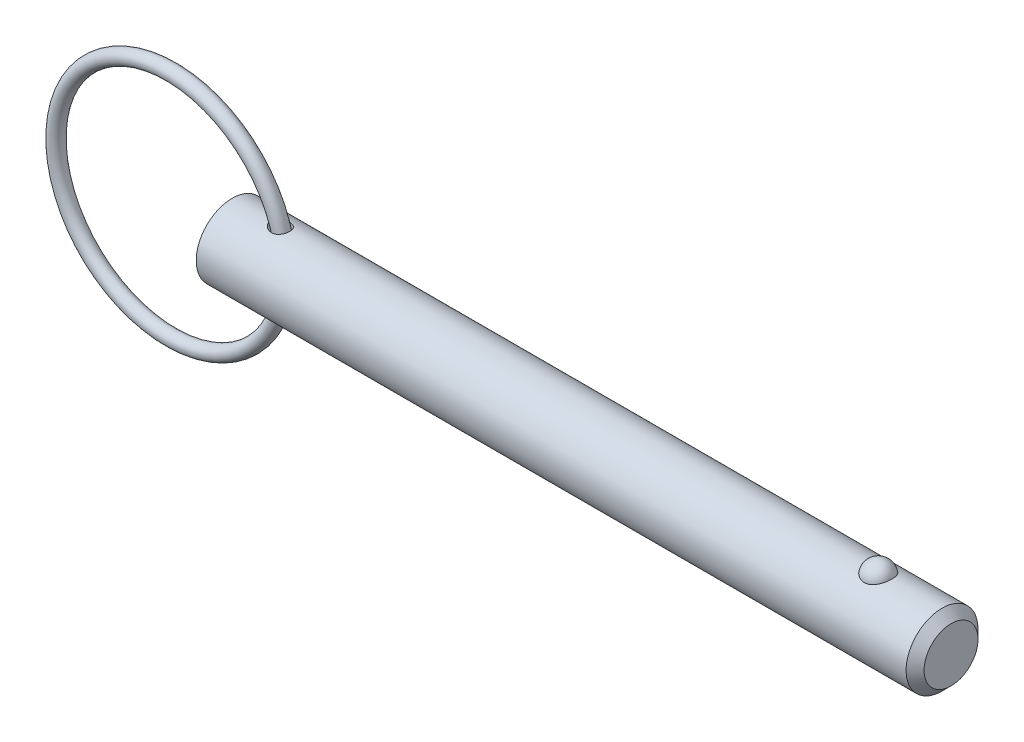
ISO-10303-21;
HEADER;
FILE_DESCRIPTION(('STEP AP214'),'2;1');
FILE_NAME('part.step','',(''),(''),'','','');
FILE_SCHEMA(('AUTOMOTIVE_DESIGN { 1 0 10303 214 1 1 1 1 }'));
ENDSEC;
DATA;
#1=APPLICATION_CONTEXT('core data for automotive mechanical design processes');
#2=APPLICATION_PROTOCOL_DEFINITION('international standard','automotive_design',2000,#1);
#3=PRODUCT_CONTEXT('',#1,'mechanical');
#4=PRODUCT('Part','Part','',(#3));
#5=PRODUCT_RELATED_PRODUCT_CATEGORY('part','',(#4));
#6=PRODUCT_DEFINITION_FORMATION('','',#4);
#7=PRODUCT_DEFINITION_CONTEXT('part definition',#1,'design');
#8=PRODUCT_DEFINITION('design','',#6,#7);
#9=PRODUCT_DEFINITION_SHAPE('','',#8);
#10=(LENGTH_UNIT() NAMED_UNIT(*) SI_UNIT(.MILLI.,.METRE.));
#11=(NAMED_UNIT(*) PLANE_ANGLE_UNIT() SI_UNIT($,.RADIAN.));
#12=(NAMED_UNIT(*) SI_UNIT($,.STERADIAN.) SOLID_ANGLE_UNIT());
#13=UNCERTAINTY_MEASURE_WITH_UNIT(LENGTH_MEASURE(1.E-05),#10,'distance_accuracy_value','');
#14=(GEOMETRIC_REPRESENTATION_CONTEXT(3) GLOBAL_UNCERTAINTY_ASSIGNED_CONTEXT((#13)) GLOBAL_UNIT_ASSIGNED_CONTEXT((#10,
#11,#12)) REPRESENTATION_CONTEXT('',''));
#15=CARTESIAN_POINT('',(0.,0.,0.));
#16=DIRECTION('',(0.,0.,1.));
#17=DIRECTION('',(1.,0.,0.));
#18=AXIS2_PLACEMENT_3D('',#15,#16,#17);
#19=CARTESIAN_POINT('',(-6.75433730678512,0.,0.));
#20=DIRECTION('',(0.,0.,1.));
#21=DIRECTION('',(1.,0.,0.));
#22=AXIS2_PLACEMENT_3D('',#19,#20,#21);
#23=TOROIDAL_SURFACE('',#22,12.7,0.794);
#24=CARTESIAN_POINT('',(6.73966269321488,0.,0.));
#25=VERTEX_POINT('',#24);
#26=VERTEX_LOOP('',#25);
#27=FACE_BOUND('',#26,.T.);
#28=ADVANCED_FACE('P0_F12',(#27),#23,.T.);
#29=CLOSED_SHELL('',(#28));
#30=MANIFOLD_SOLID_BREP('P0_B1',#29);
#31=CARTESIAN_POINT('',(0.,0.,0.));
#32=DIRECTION('',(1.,0.,0.));
#33=DIRECTION('',(0.,0.,-1.));
#34=AXIS2_PLACEMENT_3D('',#31,#32,#33);
#35=CYLINDRICAL_SURFACE('',#34,3.97);
#36=CARTESIAN_POINT('',(4.47423598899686,3.9272127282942,-0.581291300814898));
#37=CARTESIAN_POINT('',(4.51402362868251,3.92000695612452,-0.62997219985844));
#38=CARTESIAN_POINT('',(4.55825642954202,3.91241085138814,-0.675032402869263));
#39=CARTESIAN_POINT('',(4.65378532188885,3.8973704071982,-0.757069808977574));
#40=CARTESIAN_POINT('',(4.70509780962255,3.88992646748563,-0.794027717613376));
#41=CARTESIAN_POINT('',(4.81300878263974,3.87608600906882,-0.859045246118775));
#42=CARTESIAN_POINT('',(4.86959180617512,3.86968656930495,-0.887129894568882));
#43=CARTESIAN_POINT('',(4.98666757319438,3.85867771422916,-0.933854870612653));
#44=CARTESIAN_POINT('',(5.04715829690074,3.85406738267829,-0.952500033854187));
#45=CARTESIAN_POINT('',(5.17222686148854,3.84716625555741,-0.980011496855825));
#46=CARTESIAN_POINT('',(5.23687124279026,3.84494236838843,-0.988596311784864));
#47=CARTESIAN_POINT('',(5.36671178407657,3.84347581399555,-0.994286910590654));
#48=CARTESIAN_POINT('',(5.43190770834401,3.84423193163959,-0.991397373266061));
#49=CARTESIAN_POINT('',(5.5560514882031,3.84859691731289,-0.974304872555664));
#50=CARTESIAN_POINT('',(5.61511712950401,3.85200226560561,-0.960908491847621));
#51=CARTESIAN_POINT('',(5.72974412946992,3.8610605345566,-0.923836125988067));
#52=CARTESIAN_POINT('',(5.78530708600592,3.86671242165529,-0.90016486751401));
#53=CARTESIAN_POINT('',(5.88712740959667,3.87908259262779,-0.845190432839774));
#54=CARTESIAN_POINT('',(5.93376792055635,3.88569301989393,-0.814569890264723));
#55=CARTESIAN_POINT('',(6.02101503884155,3.89947732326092,-0.745789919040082));
#56=CARTESIAN_POINT('',(6.06162229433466,3.90665113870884,-0.707631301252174));
#57=CARTESIAN_POINT('',(6.13496290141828,3.9206013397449,-0.625680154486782));
#58=CARTESIAN_POINT('',(6.16783367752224,3.92738273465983,-0.582011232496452));
#59=CARTESIAN_POINT('',(6.2258925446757,3.93995609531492,-0.489706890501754));
#60=CARTESIAN_POINT('',(6.25108046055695,3.94574803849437,-0.441071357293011));
#61=CARTESIAN_POINT('',(6.29336449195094,3.95576358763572,-0.339770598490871));
#62=CARTESIAN_POINT('',(6.31039150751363,3.95997373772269,-0.28707520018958));
#63=CARTESIAN_POINT('',(6.33565624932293,3.96630600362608,-0.179496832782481));
#64=CARTESIAN_POINT('',(6.34389366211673,3.96842804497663,-0.124613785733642));
#65=CARTESIAN_POINT('',(6.35142037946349,3.97036465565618,-0.0138440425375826));
#66=CARTESIAN_POINT('',(6.35065227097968,3.97016441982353,0.0420468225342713));
#67=CARTESIAN_POINT('',(6.34004566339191,3.96744188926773,0.152904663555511));
#68=CARTESIAN_POINT('',(6.33020697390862,3.96491954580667,0.207871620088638));
#69=CARTESIAN_POINT('',(6.30166659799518,3.95782104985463,0.315369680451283));
#70=CARTESIAN_POINT('',(6.28295698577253,3.95324306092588,0.36789855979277));
#71=CARTESIAN_POINT('',(6.23710200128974,3.94253162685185,0.468965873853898));
#72=CARTESIAN_POINT('',(6.20995670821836,3.93639819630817,0.517504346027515));
#73=CARTESIAN_POINT('',(6.14798638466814,3.92327702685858,0.609041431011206));
#74=CARTESIAN_POINT('',(6.11318666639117,3.91629213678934,0.652057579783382));
#75=CARTESIAN_POINT('',(6.03675089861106,3.90223639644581,0.731492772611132));
#76=CARTESIAN_POINT('',(5.99511563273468,3.89516555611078,0.767912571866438));
#77=CARTESIAN_POINT('',(5.90657479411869,3.88180215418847,0.832828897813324));
#78=CARTESIAN_POINT('',(5.85972260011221,3.87550288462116,0.86139687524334));
#79=CARTESIAN_POINT('',(5.76177854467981,3.86429747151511,0.910350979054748));
#80=CARTESIAN_POINT('',(5.71068697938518,3.8593912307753,0.930737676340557));
#81=CARTESIAN_POINT('',(5.60571987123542,3.85147434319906,0.962976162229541));
#82=CARTESIAN_POINT('',(5.55184284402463,3.84846471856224,0.974823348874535));
#83=CARTESIAN_POINT('',(5.44283210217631,3.84460058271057,0.989953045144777));
#84=CARTESIAN_POINT('',(5.38769814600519,3.84374648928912,0.99323389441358));
#85=CARTESIAN_POINT('',(5.27524330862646,3.84420584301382,0.991454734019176));
#86=CARTESIAN_POINT('',(5.21792896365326,3.84561285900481,0.986034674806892));
#87=CARTESIAN_POINT('',(5.1048579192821,3.85052758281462,0.966661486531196));
#88=CARTESIAN_POINT('',(5.04910180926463,3.85403607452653,0.952705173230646));
#89=CARTESIAN_POINT('',(4.93593174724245,3.86308835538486,0.915340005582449));
#90=CARTESIAN_POINT('',(4.8787523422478,3.86877458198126,0.891254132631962));
#91=CARTESIAN_POINT('',(4.7690169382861,3.88143650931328,0.83438431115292));
#92=CARTESIAN_POINT('',(4.71646372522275,3.88841297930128,0.801595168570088));
#93=CARTESIAN_POINT('',(4.61492504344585,3.90324173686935,0.726056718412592));
#94=CARTESIAN_POINT('',(4.56625259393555,3.91112043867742,0.682888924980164));
#95=CARTESIAN_POINT('',(4.47749220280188,3.92644930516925,0.588370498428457));
#96=CARTESIAN_POINT('',(4.43740132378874,3.93389961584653,0.537022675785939));
#97=CARTESIAN_POINT('',(4.37035516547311,3.94686586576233,0.431042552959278));
#98=CARTESIAN_POINT('',(4.34268823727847,3.95247934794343,0.376876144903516));
#99=CARTESIAN_POINT('',(4.29855851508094,3.96161331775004,0.264011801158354));
#100=CARTESIAN_POINT('',(4.28207681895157,3.96513733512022,0.20532169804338));
#101=CARTESIAN_POINT('',(4.26319409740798,3.96919493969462,0.094762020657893));
#102=CARTESIAN_POINT('',(4.25904206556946,3.97009986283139,0.0432014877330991));
#103=CARTESIAN_POINT('',(4.26004223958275,3.9698827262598,-0.0598293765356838));
#104=CARTESIAN_POINT('',(4.26519288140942,3.96876100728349,-0.111299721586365));
#105=CARTESIAN_POINT('',(4.28369027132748,3.96479623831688,-0.208517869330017));
#106=CARTESIAN_POINT('',(4.29637416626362,3.96209263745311,-0.25440084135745));
#107=CARTESIAN_POINT('',(4.32867922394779,3.95536287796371,-0.343510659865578));
#108=CARTESIAN_POINT('',(4.34829584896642,3.95133758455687,-0.386739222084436));
#109=CARTESIAN_POINT('',(4.38573190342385,3.94389838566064,-0.455314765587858));
#110=CARTESIAN_POINT('',(4.40181371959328,3.94075686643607,-0.481662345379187));
#111=CARTESIAN_POINT('',(4.43632024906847,3.93417901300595,-0.532726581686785));
#112=CARTESIAN_POINT('',(4.45474473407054,3.93074270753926,-0.557443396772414));
#113=CARTESIAN_POINT('',(4.47423598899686,3.9272127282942,-0.581291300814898));
#114=B_SPLINE_CURVE_WITH_KNOTS('',3,(#36,#37,#38,#39,#40,#41,#42,#43,#44,#45,#46,#47,#48,#49,
#50,#51,#52,#53,#54,#55,#56,#57,#58,#59,#60,#61,#62,#63,#64,#65,#66,#67,#68,#69,#70,#71,#72,#73,
#74,#75,#76,#77,#78,#79,#80,#81,#82,#83,#84,#85,#86,#87,#88,#89,#90,#91,#92,#93,#94,#95,#96,#97,
#98,#99,#100,#101,#102,#103,#104,#105,#106,#107,#108,#109,#110,#111,#112,#113),.UNSPECIFIED.,
.T.,.F.,(4,2,2,2,2,2,2,2,2,2,2,2,2,2,2,2,2,2,2,2,2,2,2,2,2,2,2,2,2,2,2,2,2,2,2,2,2,2,4),(0.,
0.189730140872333,0.379907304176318,0.569543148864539,0.759081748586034,0.953805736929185,
1.148450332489,1.32946176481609,1.51039001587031,1.67812095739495,1.84583386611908,
2.01029437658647,2.17475863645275,2.34059186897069,2.50643101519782,2.67332801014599,
2.84022850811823,3.00727840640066,3.17432673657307,3.34083074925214,3.50731568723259,
3.67223129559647,3.83713539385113,4.00212829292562,4.16715316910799,4.33918465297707,
4.5112803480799,4.69738596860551,4.88360290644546,5.07919911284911,5.27472826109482,
5.45686425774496,5.63869168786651,5.79305070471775,5.94738377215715,6.08981233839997,
6.2321478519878,6.3251023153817,6.4180477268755),.UNSPECIFIED.);
#115=CARTESIAN_POINT('',(4.47423598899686,3.9272127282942,-0.581291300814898));
#116=VERTEX_POINT('',#115);
#117=EDGE_CURVE('P1_E40',#116,#116,#114,.T.);
#118=ORIENTED_EDGE('',*,*,#117,.T.);
#119=EDGE_LOOP('',(#118));
#120=FACE_BOUND('',#119,.T.);
#121=CARTESIAN_POINT('',(78.3875,0.,0.));
#122=DIRECTION('',(1.,0.,0.));
#123=DIRECTION('',(0.,0.,-1.));
#124=AXIS2_PLACEMENT_3D('',#121,#122,#123);
#125=CIRCLE('',#124,3.97);
#126=CARTESIAN_POINT('',(78.3875,0.,-3.97));
#127=VERTEX_POINT('',#126);
#128=EDGE_CURVE('P1_E25',#127,#127,#125,.T.);
#129=ORIENTED_EDGE('',*,*,#128,.F.);
#130=EDGE_LOOP('',(#129));
#131=FACE_BOUND('',#130,.T.);
#132=CARTESIAN_POINT('',(0.,0.,0.));
#133=DIRECTION('',(1.,0.,0.));
#134=DIRECTION('',(0.,0.,-1.));
#135=AXIS2_PLACEMENT_3D('',#132,#133,#134);
#136=CIRCLE('',#135,3.97);
#137=CARTESIAN_POINT('',(0.,0.,-3.97));
#138=VERTEX_POINT('',#137);
#139=EDGE_CURVE('P1_E9',#138,#138,#136,.T.);
#140=ORIENTED_EDGE('',*,*,#139,.T.);
#141=EDGE_LOOP('',(#140));
#142=FACE_BOUND('',#141,.T.);
#143=CARTESIAN_POINT('',(71.3451922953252,3.65715365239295,1.5447094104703));
#144=CARTESIAN_POINT('',(71.2652448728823,3.65716001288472,1.54470290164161));
#145=CARTESIAN_POINT('',(71.1851650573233,3.65987074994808,1.53832549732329));
#146=CARTESIAN_POINT('',(71.0272374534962,3.6704221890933,1.51297018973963));
#147=CARTESIAN_POINT('',(70.9493961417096,3.67827646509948,1.49395894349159));
#148=CARTESIAN_POINT('',(70.7984614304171,3.69818848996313,1.4439595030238));
#149=CARTESIAN_POINT('',(70.7253560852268,3.71023513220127,1.41300293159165));
#150=CARTESIAN_POINT('',(70.5855630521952,3.7372183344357,1.34000212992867));
#151=CARTESIAN_POINT('',(70.5188725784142,3.75215363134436,1.29796274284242));
#152=CARTESIAN_POINT('',(70.3914886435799,3.78384968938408,1.20248834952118));
#153=CARTESIAN_POINT('',(70.3310299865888,3.80065129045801,1.14875388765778));
#154=CARTESIAN_POINT('',(70.2196942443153,3.83398532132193,1.03205417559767));
#155=CARTESIAN_POINT('',(70.1688200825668,3.85051766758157,0.969086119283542));
#156=CARTESIAN_POINT('',(70.0756321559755,3.88238608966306,0.832526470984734));
#157=CARTESIAN_POINT('',(70.0337961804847,3.89763698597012,0.758588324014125));
#158=CARTESIAN_POINT('',(69.9625108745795,3.92451063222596,0.604352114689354));
#159=CARTESIAN_POINT('',(69.9330623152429,3.93613315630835,0.52405365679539));
#160=CARTESIAN_POINT('',(69.8868927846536,3.95467606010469,0.358403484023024));
#161=CARTESIAN_POINT('',(69.8703127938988,3.96154426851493,0.273006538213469));
#162=CARTESIAN_POINT('',(69.850756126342,3.96967008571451,0.100408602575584));
#163=CARTESIAN_POINT('',(69.8477789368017,3.97092790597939,0.013207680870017));
#164=CARTESIAN_POINT('',(69.8554587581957,3.96771794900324,-0.159844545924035));
#165=CARTESIAN_POINT('',(69.8660164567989,3.96329187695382,-0.245701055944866));
#166=CARTESIAN_POINT('',(69.9003800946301,3.94923163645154,-0.41427746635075));
#167=CARTESIAN_POINT('',(69.9241862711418,3.93959737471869,-0.496997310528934));
#168=CARTESIAN_POINT('',(69.9846114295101,3.91607752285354,-0.657113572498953));
#169=CARTESIAN_POINT('',(70.0212495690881,3.90218558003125,-0.734501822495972));
#170=CARTESIAN_POINT('',(70.1065935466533,3.87158287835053,-0.881704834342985));
#171=CARTESIAN_POINT('',(70.1553004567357,3.8548718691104,-0.951518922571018));
#172=CARTESIAN_POINT('',(70.2641161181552,3.82028735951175,-1.08208159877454));
#173=CARTESIAN_POINT('',(70.3242955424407,3.80240713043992,-1.14276958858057));
#174=CARTESIAN_POINT('',(70.454493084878,3.76758161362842,-1.2528243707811));
#175=CARTESIAN_POINT('',(70.5245105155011,3.75063626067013,-1.30219195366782));
#176=CARTESIAN_POINT('',(70.67118160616,3.71998948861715,-1.38729709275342));
#177=CARTESIAN_POINT('',(70.7476813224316,3.70623183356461,-1.42327904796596));
#178=CARTESIAN_POINT('',(70.9062981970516,3.68323188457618,-1.48178996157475));
#179=CARTESIAN_POINT('',(70.9884132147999,3.67398788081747,-1.50432401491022));
#180=CARTESIAN_POINT('',(71.1514810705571,3.6615216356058,-1.53440939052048));
#181=CARTESIAN_POINT('',(71.2322840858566,3.65801951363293,-1.54265826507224));
#182=CARTESIAN_POINT('',(71.3942085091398,3.65657341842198,-1.54608423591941));
#183=CARTESIAN_POINT('',(71.4753298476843,3.65862829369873,-1.5412640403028));
#184=CARTESIAN_POINT('',(71.6328122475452,3.66788969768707,-1.51908474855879));
#185=CARTESIAN_POINT('',(71.7092422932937,3.67492621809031,-1.50213925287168));
#186=CARTESIAN_POINT('',(71.8580412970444,3.69318404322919,-1.4566698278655));
#187=CARTESIAN_POINT('',(71.9304099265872,3.7044056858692,-1.42814496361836));
#188=CARTESIAN_POINT('',(72.0708029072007,3.73012749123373,-1.35956319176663));
#189=CARTESIAN_POINT('',(72.1387000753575,3.74469307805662,-1.31927107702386));
#190=CARTESIAN_POINT('',(72.2668649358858,3.77545272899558,-1.22847440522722));
#191=CARTESIAN_POINT('',(72.3271308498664,3.79164717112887,-1.17796747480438));
#192=CARTESIAN_POINT('',(72.4416346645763,3.82490325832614,-1.06519260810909));
#193=CARTESIAN_POINT('',(72.4954137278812,3.84196735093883,-1.00245914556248));
#194=CARTESIAN_POINT('',(72.5920988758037,3.87439863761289,-0.86871586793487));
#195=CARTESIAN_POINT('',(72.6350030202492,3.88976552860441,-0.79770457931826));
#196=CARTESIAN_POINT('',(72.710266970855,3.91771381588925,-0.646896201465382));
#197=CARTESIAN_POINT('',(72.7422532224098,3.93019255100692,-0.566893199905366));
#198=CARTESIAN_POINT('',(72.7931101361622,3.95043886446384,-0.402255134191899));
#199=CARTESIAN_POINT('',(72.8119807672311,3.95820643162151,-0.31762005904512));
#200=CARTESIAN_POINT('',(72.8362162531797,3.96823733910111,-0.146156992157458));
#201=CARTESIAN_POINT('',(72.8415874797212,3.970503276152,-0.0593300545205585));
#202=CARTESIAN_POINT('',(72.8387309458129,3.96930811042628,0.114057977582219));
#203=CARTESIAN_POINT('',(72.8305035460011,3.9658471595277,0.200619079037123));
#204=CARTESIAN_POINT('',(72.8007063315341,3.95358562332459,0.370506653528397));
#205=CARTESIAN_POINT('',(72.7792129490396,3.94481563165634,0.453848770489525));
#206=CARTESIAN_POINT('',(72.7233839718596,3.92284586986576,0.615497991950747));
#207=CARTESIAN_POINT('',(72.6890474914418,3.90964579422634,0.693804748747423));
#208=CARTESIAN_POINT('',(72.6079702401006,3.88006987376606,0.843703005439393));
#209=CARTESIAN_POINT('',(72.5611536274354,3.86367478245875,0.915249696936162));
#210=CARTESIAN_POINT('',(72.4561897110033,3.82949741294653,1.04910810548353));
#211=CARTESIAN_POINT('',(72.3980428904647,3.81171519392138,1.1114202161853));
#212=CARTESIAN_POINT('',(72.2717433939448,3.77673366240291,1.22503948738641));
#213=CARTESIAN_POINT('',(72.2035970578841,3.75953398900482,1.27635357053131));
#214=CARTESIAN_POINT('',(72.0589009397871,3.72770506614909,1.36653336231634));
#215=CARTESIAN_POINT('',(71.982348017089,3.7130767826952,1.40539439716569));
#216=CARTESIAN_POINT('',(71.8257594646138,3.68864287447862,1.46830480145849));
#217=CARTESIAN_POINT('',(71.7459307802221,3.67869017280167,1.49281289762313));
#218=CARTESIAN_POINT('',(71.5829877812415,3.66414535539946,1.52817474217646));
#219=CARTESIAN_POINT('',(71.4998840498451,3.65953723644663,1.53906926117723));
#220=CARTESIAN_POINT('',(71.3927760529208,3.6573894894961,1.54414878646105));
#221=CARTESIAN_POINT('',(71.3689900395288,3.65715175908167,1.54471134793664));
#222=CARTESIAN_POINT('',(71.3451922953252,3.65715365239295,1.5447094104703));
#223=B_SPLINE_CURVE_WITH_KNOTS('',3,(#143,#144,#145,#146,#147,#148,#149,#150,#151,#152,#153,
#154,#155,#156,#157,#158,#159,#160,#161,#162,#163,#164,#165,#166,#167,#168,#169,#170,#171,#172,
#173,#174,#175,#176,#177,#178,#179,#180,#181,#182,#183,#184,#185,#186,#187,#188,#189,#190,#191,
#192,#193,#194,#195,#196,#197,#198,#199,#200,#201,#202,#203,#204,#205,#206,#207,#208,#209,#210,
#211,#212,#213,#214,#215,#216,#217,#218,#219,#220,#221,#222),.UNSPECIFIED.,.T.,.F.,(4,2,2,2,2,2,
2,2,2,2,2,2,2,2,2,2,2,2,2,2,2,2,2,2,2,2,2,2,2,2,2,2,2,2,2,2,2,2,2,4),(0.,0.239777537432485,
0.480190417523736,0.719971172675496,0.9596473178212,1.20639040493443,1.45320863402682,
1.71093679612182,1.9686809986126,2.22921052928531,2.48973023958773,2.74834928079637,
3.00697295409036,3.26598440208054,3.52501886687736,3.78570385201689,4.04637062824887,
4.30201257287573,4.55755760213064,4.80022994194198,5.04285200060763,5.27757006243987,
5.51230707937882,5.7521012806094,5.99195126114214,6.24392810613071,6.49594987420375,
6.75588818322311,7.01582710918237,7.27564332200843,7.5354526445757,7.79377886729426,
8.05212290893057,8.31207418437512,8.57201437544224,8.83179046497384,9.09166393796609,
9.34270057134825,9.59298357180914,9.66435753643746),.UNSPECIFIED.);
#224=CARTESIAN_POINT('',(71.3451922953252,3.65715365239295,1.5447094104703));
#225=VERTEX_POINT('',#224);
#226=EDGE_CURVE('P1_E34',#225,#225,#223,.T.);
#227=ORIENTED_EDGE('',*,*,#226,.T.);
#228=EDGE_LOOP('',(#227));
#229=FACE_BOUND('',#228,.T.);
#230=CARTESIAN_POINT('',(4.47423598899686,-3.9272127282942,-0.581291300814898));
#231=CARTESIAN_POINT('',(4.44128910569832,-3.93317954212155,-0.540978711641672));
#232=CARTESIAN_POINT('',(4.41136828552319,-3.93888228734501,-0.498159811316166));
#233=CARTESIAN_POINT('',(4.35872676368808,-3.94921939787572,-0.408179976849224));
#234=CARTESIAN_POINT('',(4.33600082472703,-3.95385453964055,-0.36102223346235));
#235=CARTESIAN_POINT('',(4.29878526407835,-3.9615772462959,-0.263108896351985));
#236=CARTESIAN_POINT('',(4.28434166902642,-3.96465615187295,-0.212334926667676));
#237=CARTESIAN_POINT('',(4.26481927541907,-3.96884157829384,-0.108934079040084));
#238=CARTESIAN_POINT('',(4.25973608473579,-3.96994902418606,-0.0563080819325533));
#239=CARTESIAN_POINT('',(4.25930094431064,-3.97004379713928,0.0449240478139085));
#240=CARTESIAN_POINT('',(4.26323134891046,-3.96918747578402,0.0935283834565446));
#241=CARTESIAN_POINT('',(4.27911923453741,-3.96577236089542,0.189336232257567));
#242=CARTESIAN_POINT('',(4.29107713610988,-3.96321347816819,0.236539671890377));
#243=CARTESIAN_POINT('',(4.3222019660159,-3.95670052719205,0.327873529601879));
#244=CARTESIAN_POINT('',(4.34129939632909,-3.95275993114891,0.37202886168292));
#245=CARTESIAN_POINT('',(4.38584298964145,-3.94385347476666,0.456884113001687));
#246=CARTESIAN_POINT('',(4.41129114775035,-3.93888729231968,0.497582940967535));
#247=CARTESIAN_POINT('',(4.47067915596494,-3.92777410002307,0.57910486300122));
#248=CARTESIAN_POINT('',(4.50523982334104,-3.92155746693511,0.61946509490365));
#249=CARTESIAN_POINT('',(4.57989786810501,-3.90894004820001,0.694653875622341));
#250=CARTESIAN_POINT('',(4.61999845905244,-3.90253915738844,0.729479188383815));
#251=CARTESIAN_POINT('',(4.7106931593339,-3.88921622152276,0.79766500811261));
#252=CARTESIAN_POINT('',(4.76196990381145,-3.88234748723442,0.830130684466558));
#253=CARTESIAN_POINT('',(4.86907659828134,-3.86980743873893,0.886754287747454));
#254=CARTESIAN_POINT('',(4.92490895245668,-3.86413676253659,0.91090779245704));
#255=CARTESIAN_POINT('',(5.04387274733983,-3.85430959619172,0.951667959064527));
#256=CARTESIAN_POINT('',(5.10724127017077,-3.85028805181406,0.967622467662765));
#257=CARTESIAN_POINT('',(5.23589558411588,-3.84499084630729,0.988466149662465));
#258=CARTESIAN_POINT('',(5.30118075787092,-3.84371431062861,0.993358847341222));
#259=CARTESIAN_POINT('',(5.42870419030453,-3.84421020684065,0.991437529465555));
#260=CARTESIAN_POINT('',(5.49094970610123,-3.84585050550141,0.985130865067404));
#261=CARTESIAN_POINT('',(5.61317445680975,-3.85182888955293,0.961489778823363));
#262=CARTESIAN_POINT('',(5.67315499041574,-3.85616540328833,0.944161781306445));
#263=CARTESIAN_POINT('',(5.78385047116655,-3.86655540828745,0.900611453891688));
#264=CARTESIAN_POINT('',(5.83492113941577,-3.87243611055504,0.875248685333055));
#265=CARTESIAN_POINT('',(5.93173444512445,-3.88533932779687,0.816058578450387));
#266=CARTESIAN_POINT('',(5.97747806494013,-3.89236163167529,0.78223280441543));
#267=CARTESIAN_POINT('',(6.06067538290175,-3.90644082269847,0.708499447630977));
#268=CARTESIAN_POINT('',(6.09837515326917,-3.9134865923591,0.668866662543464));
#269=CARTESIAN_POINT('',(6.16659675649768,-3.92708124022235,0.583768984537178));
#270=CARTESIAN_POINT('',(6.19711866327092,-3.93363012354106,0.538304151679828));
#271=CARTESIAN_POINT('',(6.25033980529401,-3.94554016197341,0.44265233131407));
#272=CARTESIAN_POINT('',(6.27301093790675,-3.95089702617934,0.392449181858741));
#273=CARTESIAN_POINT('',(6.3098605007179,-3.95981777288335,0.288866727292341));
#274=CARTESIAN_POINT('',(6.32403857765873,-3.96338158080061,0.235487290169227));
#275=CARTESIAN_POINT('',(6.34366897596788,-3.96835894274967,0.126579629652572));
#276=CARTESIAN_POINT('',(6.34904619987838,-3.9697539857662,0.0710370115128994));
#277=CARTESIAN_POINT('',(6.35072157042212,-3.97018611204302,-0.0401947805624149));
#278=CARTESIAN_POINT('',(6.34701950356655,-3.96922313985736,-0.0958839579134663));
#279=CARTESIAN_POINT('',(6.33059893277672,-3.96503727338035,-0.205963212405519));
#280=CARTESIAN_POINT('',(6.31785949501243,-3.96180913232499,-0.260349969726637));
#281=CARTESIAN_POINT('',(6.28362857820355,-3.95343617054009,-0.366141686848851));
#282=CARTESIAN_POINT('',(6.26213701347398,-3.94829133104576,-0.417546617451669));
#283=CARTESIAN_POINT('',(6.21094198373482,-3.93665740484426,-0.515825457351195));
#284=CARTESIAN_POINT('',(6.18125109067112,-3.93017037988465,-0.562706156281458));
#285=CARTESIAN_POINT('',(6.11437296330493,-3.91656890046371,-0.650670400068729));
#286=CARTESIAN_POINT('',(6.07718632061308,-3.90945449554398,-0.691754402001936));
#287=CARTESIAN_POINT('',(5.99660825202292,-3.89545704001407,-0.76665430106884));
#288=CARTESIAN_POINT('',(5.95326700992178,-3.88857262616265,-0.800523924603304));
#289=CARTESIAN_POINT('',(5.86137696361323,-3.87574946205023,-0.860470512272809));
#290=CARTESIAN_POINT('',(5.81282877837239,-3.86981059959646,-0.886548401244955));
#291=CARTESIAN_POINT('',(5.71225875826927,-3.85955823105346,-0.93016771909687));
#292=CARTESIAN_POINT('',(5.6602610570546,-3.85523459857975,-0.947762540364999));
#293=CARTESIAN_POINT('',(5.55400860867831,-3.84858369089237,-0.974419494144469));
#294=CARTESIAN_POINT('',(5.49975362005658,-3.84625662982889,-0.983480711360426));
#295=CARTESIAN_POINT('',(5.38905619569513,-3.84373902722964,-0.99327593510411));
#296=CARTESIAN_POINT('',(5.33259335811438,-3.8436048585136,-0.993790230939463));
#297=CARTESIAN_POINT('',(5.22028568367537,-3.84553679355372,-0.986285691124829));
#298=CARTESIAN_POINT('',(5.16444101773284,-3.84760349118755,-0.978264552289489));
#299=CARTESIAN_POINT('',(5.05063804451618,-3.85386728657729,-0.953301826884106));
#300=CARTESIAN_POINT('',(4.99282059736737,-3.85820814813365,-0.935754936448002));
#301=CARTESIAN_POINT('',(4.88067115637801,-3.86855108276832,-0.89202836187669));
#302=CARTESIAN_POINT('',(4.82634209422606,-3.87455453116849,-0.865841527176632));
#303=CARTESIAN_POINT('',(4.71735796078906,-3.8882057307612,-0.802439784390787));
#304=CARTESIAN_POINT('',(4.66319676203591,-3.89595714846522,-0.764393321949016));
#305=CARTESIAN_POINT('',(4.5624904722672,-3.9116844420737,-0.679328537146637));
#306=CARTESIAN_POINT('',(4.51593909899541,-3.9196601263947,-0.632317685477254));
#307=CARTESIAN_POINT('',(4.47423598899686,-3.9272127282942,-0.581291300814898));
#308=B_SPLINE_CURVE_WITH_KNOTS('',3,(#230,#231,#232,#233,#234,#235,#236,#237,#238,#239,#240,
#241,#242,#243,#244,#245,#246,#247,#248,#249,#250,#251,#252,#253,#254,#255,#256,#257,#258,#259,
#260,#261,#262,#263,#264,#265,#266,#267,#268,#269,#270,#271,#272,#273,#274,#275,#276,#277,#278,
#279,#280,#281,#282,#283,#284,#285,#286,#287,#288,#289,#290,#291,#292,#293,#294,#295,#296,#297,
#298,#299,#300,#301,#302,#303,#304,#305,#306,#307),.UNSPECIFIED.,.T.,.F.,(4,2,2,2,2,2,2,2,2,2,2,
2,2,2,2,2,2,2,2,2,2,2,2,2,2,2,2,2,2,2,2,2,2,2,2,2,2,2,4),(0.,0.157032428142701,
0.313950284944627,0.47173191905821,0.629439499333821,0.775030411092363,0.920628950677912,
1.06484561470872,1.20910764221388,1.36897610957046,1.5289377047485,1.71139614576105,
1.89395150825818,2.08937788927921,2.28474199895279,2.4714801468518,2.65810954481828,
2.82921764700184,3.00029414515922,3.16497190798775,3.32964797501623,3.49490756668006,
3.66017403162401,3.82684349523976,3.99351687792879,4.16057760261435,4.3276399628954,
4.49444757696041,4.66124203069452,4.82674719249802,4.99223270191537,5.15666259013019,
5.32111011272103,5.48977863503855,5.6584926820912,5.83945443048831,6.02056632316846,
6.21949800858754,6.41826462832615),.UNSPECIFIED.);
#309=CARTESIAN_POINT('',(4.47423598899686,-3.9272127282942,-0.581291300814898));
#310=VERTEX_POINT('',#309);
#311=EDGE_CURVE('P1_E17',#310,#310,#308,.T.);
#312=ORIENTED_EDGE('',*,*,#311,.T.);
#313=EDGE_LOOP('',(#312));
#314=FACE_BOUND('',#313,.T.);
#315=ADVANCED_FACE('P1_F13',(#120,#131,#142,#229,#314),#35,.T.);
#316=CARTESIAN_POINT('',(0.,0.,0.));
#317=DIRECTION('',(-1.,0.,0.));
#318=DIRECTION('',(0.,0.,1.));
#319=AXIS2_PLACEMENT_3D('',#316,#317,#318);
#320=PLANE('',#319);
#321=ORIENTED_EDGE('',*,*,#139,.F.);
#322=EDGE_LOOP('',(#321));
#323=FACE_BOUND('',#322,.T.);
#324=ADVANCED_FACE('P1_F15',(#323),#320,.T.);
#325=CARTESIAN_POINT('',(79.38,0.,0.));
#326=DIRECTION('',(-1.,0.,0.));
#327=DIRECTION('',(0.,0.,1.));
#328=AXIS2_PLACEMENT_3D('',#325,#326,#327);
#329=CONICAL_SURFACE('',#328,2.97750000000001,0.785398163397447);
#330=ORIENTED_EDGE('',*,*,#128,.T.);
#331=EDGE_LOOP('',(#330));
#332=FACE_BOUND('',#331,.T.);
#333=CARTESIAN_POINT('',(79.38,0.,0.));
#334=DIRECTION('',(1.,0.,0.));
#335=DIRECTION('',(0.,0.,-1.));
#336=AXIS2_PLACEMENT_3D('',#333,#334,#335);
#337=CIRCLE('',#336,2.97750000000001);
#338=CARTESIAN_POINT('',(79.38,0.,-2.97750000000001));
#339=VERTEX_POINT('',#338);
#340=EDGE_CURVE('P1_E30',#339,#339,#337,.T.);
#341=ORIENTED_EDGE('',*,*,#340,.F.);
#342=EDGE_LOOP('',(#341));
#343=FACE_BOUND('',#342,.T.);
#344=ADVANCED_FACE('P1_F55',(#332,#343),#329,.T.);
#345=CARTESIAN_POINT('',(79.38,2.97750000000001,0.));
#346=DIRECTION('',(1.,0.,0.));
#347=DIRECTION('',(0.,0.,-1.));
#348=AXIS2_PLACEMENT_3D('',#345,#346,#347);
#349=PLANE('',#348);
#350=ORIENTED_EDGE('',*,*,#340,.T.);
#351=EDGE_LOOP('',(#350));
#352=FACE_BOUND('',#351,.T.);
#353=ADVANCED_FACE('P1_F51',(#352),#349,.T.);
#354=CARTESIAN_POINT('',(71.3451922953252,3.573,0.));
#355=DIRECTION('',(-1.,0.,0.));
#356=DIRECTION('',(0.,1.,0.));
#357=AXIS2_PLACEMENT_3D('',#354,#355,#356);
#358=SPHERICAL_SURFACE('',#357,1.54700000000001);
#359=ORIENTED_EDGE('',*,*,#226,.F.);
#360=EDGE_LOOP('',(#359));
#361=FACE_BOUND('',#360,.T.);
#362=ADVANCED_FACE('P1_F46',(#361),#358,.T.);
#363=CARTESIAN_POINT('',(-6.75433730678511,0.,0.));
#364=DIRECTION('',(0.,0.,1.));
#365=DIRECTION('',(1.,0.,0.));
#366=AXIS2_PLACEMENT_3D('',#363,#364,#365);
#367=TOROIDAL_SURFACE('',#366,12.7,0.9925);
#368=ORIENTED_EDGE('',*,*,#311,.F.);
#369=EDGE_LOOP('',(#368));
#370=FACE_BOUND('',#369,.T.);
#371=ORIENTED_EDGE('',*,*,#117,.F.);
#372=EDGE_LOOP('',(#371));
#373=FACE_BOUND('',#372,.T.);
#374=ADVANCED_FACE('P1_F50',(#370,#373),#367,.F.);
#375=CLOSED_SHELL('',(#315,#324,#344,#353,#362,#374));
#376=MANIFOLD_SOLID_BREP('P1_B1',#375);
#377=ADVANCED_BREP_SHAPE_REPRESENTATION('',(#18,#30,#376),#14);
#378=SHAPE_DEFINITION_REPRESENTATION(#9,#377);
ENDSEC;
END-ISO-10303-21;
